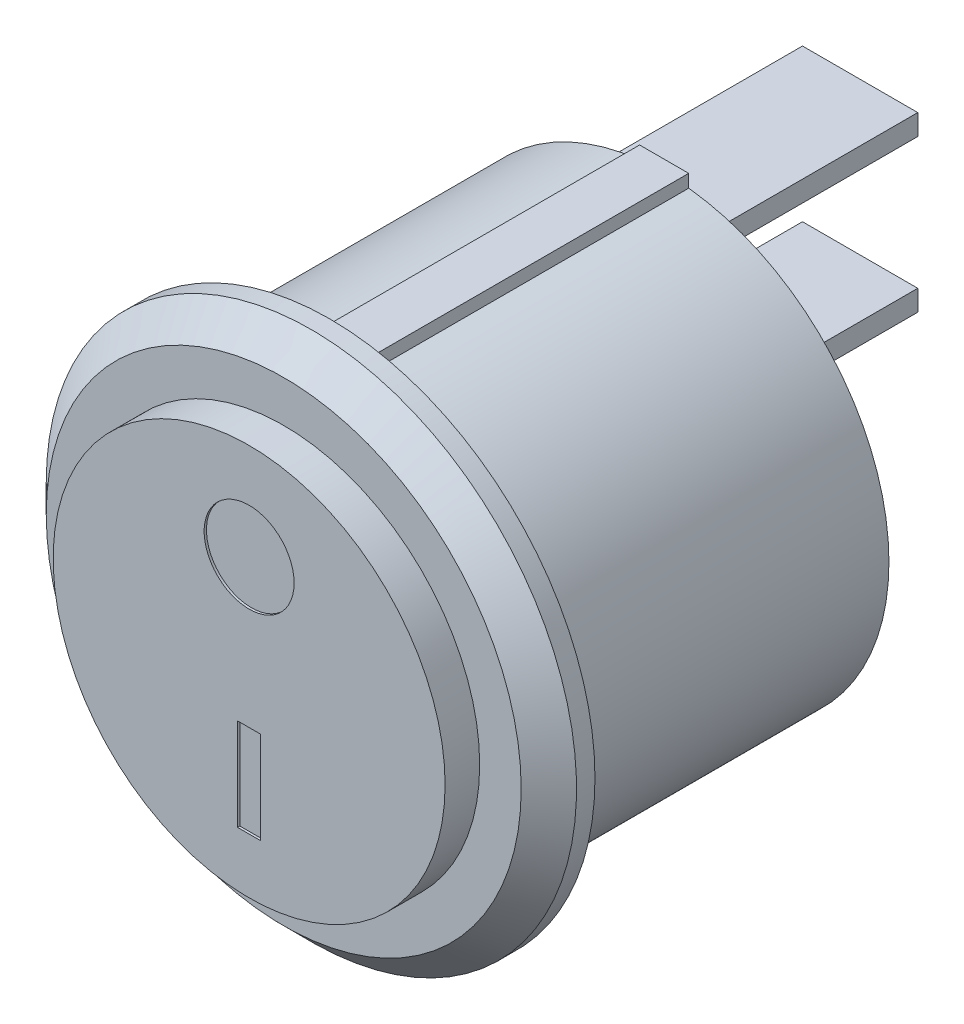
ISO-10303-21;
HEADER;
FILE_DESCRIPTION(('STEP AP214'),'2;1');
FILE_NAME('part.step','',(''),(''),'','','');
FILE_SCHEMA(('AUTOMOTIVE_DESIGN { 1 0 10303 214 1 1 1 1 }'));
ENDSEC;
DATA;
#1=APPLICATION_CONTEXT('core data for automotive mechanical design processes');
#2=APPLICATION_PROTOCOL_DEFINITION('international standard','automotive_design',2000,#1);
#3=PRODUCT_CONTEXT('',#1,'mechanical');
#4=PRODUCT('Part','Part','',(#3));
#5=PRODUCT_RELATED_PRODUCT_CATEGORY('part','',(#4));
#6=PRODUCT_DEFINITION_FORMATION('','',#4);
#7=PRODUCT_DEFINITION_CONTEXT('part definition',#1,'design');
#8=PRODUCT_DEFINITION('design','',#6,#7);
#9=PRODUCT_DEFINITION_SHAPE('','',#8);
#10=(LENGTH_UNIT() NAMED_UNIT(*) SI_UNIT(.MILLI.,.METRE.));
#11=(NAMED_UNIT(*) PLANE_ANGLE_UNIT() SI_UNIT($,.RADIAN.));
#12=(NAMED_UNIT(*) SI_UNIT($,.STERADIAN.) SOLID_ANGLE_UNIT());
#13=UNCERTAINTY_MEASURE_WITH_UNIT(LENGTH_MEASURE(1.E-05),#10,'distance_accuracy_value','');
#14=(GEOMETRIC_REPRESENTATION_CONTEXT(3) GLOBAL_UNCERTAINTY_ASSIGNED_CONTEXT((#13)) GLOBAL_UNIT_ASSIGNED_CONTEXT((#10,
#11,#12)) REPRESENTATION_CONTEXT('',''));
#15=CARTESIAN_POINT('',(0.,0.,0.));
#16=DIRECTION('',(0.,0.,1.));
#17=DIRECTION('',(1.,0.,0.));
#18=AXIS2_PLACEMENT_3D('',#15,#16,#17);
#19=CARTESIAN_POINT('',(0.,0.,14.5));
#20=DIRECTION('',(0.,0.,-1.));
#21=DIRECTION('',(-1.,0.,0.));
#22=AXIS2_PLACEMENT_3D('',#19,#20,#21);
#23=CYLINDRICAL_SURFACE('',#22,9.75);
#24=CARTESIAN_POINT('',(0.,0.,14.5));
#25=DIRECTION('',(0.,0.,1.));
#26=DIRECTION('',(1.,0.,0.));
#27=AXIS2_PLACEMENT_3D('',#24,#25,#26);
#28=CIRCLE('',#27,9.75);
#29=CARTESIAN_POINT('',(-1.06515554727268,9.6916429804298,14.5));
#30=VERTEX_POINT('',#29);
#31=CARTESIAN_POINT('',(-1.06515554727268,-9.6916429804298,14.5));
#32=VERTEX_POINT('',#31);
#33=EDGE_CURVE('E217',#30,#32,#28,.T.);
#34=ORIENTED_EDGE('',*,*,#33,.F.);
#35=DIRECTION('',(0.,0.,-1.));
#36=VECTOR('',#35,1.);
#37=CARTESIAN_POINT('',(-1.06515554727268,9.6916429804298,14.5));
#38=LINE('',#37,#36);
#39=CARTESIAN_POINT('',(-1.06515554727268,9.6916429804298,0.));
#40=VERTEX_POINT('',#39);
#41=EDGE_CURVE('E242',#30,#40,#38,.T.);
#42=ORIENTED_EDGE('',*,*,#41,.T.);
#43=CARTESIAN_POINT('',(0.,0.,0.));
#44=DIRECTION('',(0.,0.,1.));
#45=DIRECTION('',(1.,0.,0.));
#46=AXIS2_PLACEMENT_3D('',#43,#44,#45);
#47=CIRCLE('',#46,9.75);
#48=CARTESIAN_POINT('',(-1.06515554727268,-9.6916429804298,0.));
#49=VERTEX_POINT('',#48);
#50=EDGE_CURVE('E402',#40,#49,#47,.T.);
#51=ORIENTED_EDGE('',*,*,#50,.T.);
#52=DIRECTION('',(0.,0.,-1.));
#53=VECTOR('',#52,1.);
#54=CARTESIAN_POINT('',(-1.06515554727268,-9.6916429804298,14.5));
#55=LINE('',#54,#53);
#56=EDGE_CURVE('E239',#49,#32,#55,.F.);
#57=ORIENTED_EDGE('',*,*,#56,.T.);
#58=EDGE_LOOP('',(#34,#42,#51,#57));
#59=FACE_BOUND('',#58,.T.);
#60=ADVANCED_FACE('F51',(#59),#23,.T.);
#61=CARTESIAN_POINT('',(0.,0.,0.));
#62=DIRECTION('',(0.,0.,1.));
#63=DIRECTION('',(1.,0.,0.));
#64=AXIS2_PLACEMENT_3D('',#61,#62,#63);
#65=PLANE('',#64);
#66=DIRECTION('',(0.,-1.,0.));
#67=VECTOR('',#66,1.);
#68=CARTESIAN_POINT('',(2.5,9.,0.));
#69=LINE('',#68,#67);
#70=CARTESIAN_POINT('',(2.5,9.,0.));
#71=VERTEX_POINT('',#70);
#72=CARTESIAN_POINT('',(2.5,8.1,0.));
#73=VERTEX_POINT('',#72);
#74=EDGE_CURVE('E278',#71,#73,#69,.T.);
#75=ORIENTED_EDGE('',*,*,#74,.F.);
#76=DIRECTION('',(1.,0.,0.));
#77=VECTOR('',#76,1.);
#78=CARTESIAN_POINT('',(2.5,9.,0.));
#79=LINE('',#78,#77);
#80=CARTESIAN_POINT('',(-2.5,9.,0.));
#81=VERTEX_POINT('',#80);
#82=EDGE_CURVE('E295',#81,#71,#79,.T.);
#83=ORIENTED_EDGE('',*,*,#82,.F.);
#84=DIRECTION('',(0.,1.,0.));
#85=VECTOR('',#84,1.);
#86=CARTESIAN_POINT('',(-2.5,9.,0.));
#87=LINE('',#86,#85);
#88=CARTESIAN_POINT('',(-2.5,8.1,0.));
#89=VERTEX_POINT('',#88);
#90=EDGE_CURVE('E311',#89,#81,#87,.T.);
#91=ORIENTED_EDGE('',*,*,#90,.F.);
#92=DIRECTION('',(-1.,0.,0.));
#93=VECTOR('',#92,1.);
#94=CARTESIAN_POINT('',(2.5,8.1,0.));
#95=LINE('',#94,#93);
#96=EDGE_CURVE('E308',#73,#89,#95,.T.);
#97=ORIENTED_EDGE('',*,*,#96,.F.);
#98=EDGE_LOOP('',(#75,#83,#91,#97));
#99=FACE_BOUND('',#98,.T.);
#100=DIRECTION('',(0.,-1.,0.));
#101=VECTOR('',#100,1.);
#102=CARTESIAN_POINT('',(2.5,2.4,0.));
#103=LINE('',#102,#101);
#104=CARTESIAN_POINT('',(2.5,2.4,0.));
#105=VERTEX_POINT('',#104);
#106=CARTESIAN_POINT('',(2.5,1.5,0.));
#107=VERTEX_POINT('',#106);
#108=EDGE_CURVE('E274',#105,#107,#103,.T.);
#109=ORIENTED_EDGE('',*,*,#108,.F.);
#110=DIRECTION('',(1.,0.,0.));
#111=VECTOR('',#110,1.);
#112=CARTESIAN_POINT('',(2.5,2.4,0.));
#113=LINE('',#112,#111);
#114=CARTESIAN_POINT('',(-2.5,2.4,0.));
#115=VERTEX_POINT('',#114);
#116=EDGE_CURVE('E263',#115,#105,#113,.T.);
#117=ORIENTED_EDGE('',*,*,#116,.F.);
#118=DIRECTION('',(0.,1.,0.));
#119=VECTOR('',#118,1.);
#120=CARTESIAN_POINT('',(-2.5,2.4,0.));
#121=LINE('',#120,#119);
#122=CARTESIAN_POINT('',(-2.5,1.5,0.));
#123=VERTEX_POINT('',#122);
#124=EDGE_CURVE('E266',#123,#115,#121,.T.);
#125=ORIENTED_EDGE('',*,*,#124,.F.);
#126=DIRECTION('',(-1.,0.,0.));
#127=VECTOR('',#126,1.);
#128=CARTESIAN_POINT('',(2.5,1.5,0.));
#129=LINE('',#128,#127);
#130=EDGE_CURVE('E271',#107,#123,#129,.T.);
#131=ORIENTED_EDGE('',*,*,#130,.F.);
#132=EDGE_LOOP('',(#109,#117,#125,#131));
#133=FACE_BOUND('',#132,.T.);
#134=CARTESIAN_POINT('',(1.06515554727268,-9.6916429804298,0.));
#135=VERTEX_POINT('',#134);
#136=CARTESIAN_POINT('',(1.06515554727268,9.6916429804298,0.));
#137=VERTEX_POINT('',#136);
#138=EDGE_CURVE('E397',#135,#137,#47,.T.);
#139=ORIENTED_EDGE('',*,*,#138,.F.);
#140=DIRECTION('',(0.,-1.,0.));
#141=VECTOR('',#140,1.);
#142=CARTESIAN_POINT('',(1.06515554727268,10.25,0.));
#143=LINE('',#142,#141);
#144=CARTESIAN_POINT('',(1.06515554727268,-10.25,0.));
#145=VERTEX_POINT('',#144);
#146=EDGE_CURVE('E453',#135,#145,#143,.T.);
#147=ORIENTED_EDGE('',*,*,#146,.T.);
#148=DIRECTION('',(-1.,0.,0.));
#149=VECTOR('',#148,1.);
#150=CARTESIAN_POINT('',(1.06515554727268,-10.25,0.));
#151=LINE('',#150,#149);
#152=CARTESIAN_POINT('',(-1.06515554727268,-10.25,0.));
#153=VERTEX_POINT('',#152);
#154=EDGE_CURVE('E454',#145,#153,#151,.T.);
#155=ORIENTED_EDGE('',*,*,#154,.T.);
#156=DIRECTION('',(0.,1.,0.));
#157=VECTOR('',#156,1.);
#158=CARTESIAN_POINT('',(-1.06515554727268,10.25,0.));
#159=LINE('',#158,#157);
#160=EDGE_CURVE('E196',#153,#49,#159,.T.);
#161=ORIENTED_EDGE('',*,*,#160,.T.);
#162=ORIENTED_EDGE('',*,*,#50,.F.);
#163=CARTESIAN_POINT('',(-1.06515554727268,10.25,0.));
#164=VERTEX_POINT('',#163);
#165=EDGE_CURVE('E457',#40,#164,#159,.T.);
#166=ORIENTED_EDGE('',*,*,#165,.T.);
#167=DIRECTION('',(1.,0.,0.));
#168=VECTOR('',#167,1.);
#169=CARTESIAN_POINT('',(1.06515554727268,10.25,0.));
#170=LINE('',#169,#168);
#171=CARTESIAN_POINT('',(1.06515554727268,10.25,0.));
#172=VERTEX_POINT('',#171);
#173=EDGE_CURVE('E210',#164,#172,#170,.T.);
#174=ORIENTED_EDGE('',*,*,#173,.T.);
#175=EDGE_CURVE('E458',#172,#137,#143,.T.);
#176=ORIENTED_EDGE('',*,*,#175,.T.);
#177=EDGE_LOOP('',(#139,#147,#155,#161,#162,#166,#174,#176));
#178=FACE_BOUND('',#177,.T.);
#179=ADVANCED_FACE('F437',(#99,#133,#178),#65,.F.);
#180=CARTESIAN_POINT('',(1.06515554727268,-9.6916429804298,14.5));
#181=VERTEX_POINT('',#180);
#182=CARTESIAN_POINT('',(1.06515554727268,9.6916429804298,14.5));
#183=VERTEX_POINT('',#182);
#184=EDGE_CURVE('E398',#181,#183,#28,.T.);
#185=ORIENTED_EDGE('',*,*,#184,.F.);
#186=DIRECTION('',(0.,0.,-1.));
#187=VECTOR('',#186,1.);
#188=CARTESIAN_POINT('',(1.06515554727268,-9.6916429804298,14.5));
#189=LINE('',#188,#187);
#190=EDGE_CURVE('E76',#181,#135,#189,.T.);
#191=ORIENTED_EDGE('',*,*,#190,.T.);
#192=ORIENTED_EDGE('',*,*,#138,.T.);
#193=DIRECTION('',(0.,0.,-1.));
#194=VECTOR('',#193,1.);
#195=CARTESIAN_POINT('',(1.06515554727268,9.6916429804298,14.5));
#196=LINE('',#195,#194);
#197=EDGE_CURVE('E233',#137,#183,#196,.F.);
#198=ORIENTED_EDGE('',*,*,#197,.T.);
#199=EDGE_LOOP('',(#185,#191,#192,#198));
#200=FACE_BOUND('',#199,.T.);
#201=ADVANCED_FACE('F432',(#200),#23,.T.);
#202=CARTESIAN_POINT('',(0.,0.,16.5));
#203=DIRECTION('',(0.,0.,-1.));
#204=DIRECTION('',(-1.,0.,0.));
#205=AXIS2_PLACEMENT_3D('',#202,#203,#204);
#206=CYLINDRICAL_SURFACE('',#205,11.5);
#207=CARTESIAN_POINT('',(0.,0.,15.3));
#208=DIRECTION('',(0.,0.,1.));
#209=DIRECTION('',(1.,0.,0.));
#210=AXIS2_PLACEMENT_3D('',#207,#208,#209);
#211=CIRCLE('',#210,11.5);
#212=CARTESIAN_POINT('',(-11.5,0.,15.3));
#213=VERTEX_POINT('',#212);
#214=EDGE_CURVE('E393',#213,#213,#211,.F.);
#215=ORIENTED_EDGE('',*,*,#214,.T.);
#216=EDGE_LOOP('',(#215));
#217=FACE_BOUND('',#216,.T.);
#218=CARTESIAN_POINT('',(0.,0.,14.5));
#219=DIRECTION('',(0.,0.,1.));
#220=DIRECTION('',(1.,0.,0.));
#221=AXIS2_PLACEMENT_3D('',#218,#219,#220);
#222=CIRCLE('',#221,11.5);
#223=CARTESIAN_POINT('',(11.5,0.,14.5));
#224=VERTEX_POINT('',#223);
#225=EDGE_CURVE('E388',#224,#224,#222,.T.);
#226=ORIENTED_EDGE('',*,*,#225,.T.);
#227=EDGE_LOOP('',(#226));
#228=FACE_BOUND('',#227,.T.);
#229=ADVANCED_FACE('F414',(#217,#228),#206,.T.);
#230=CARTESIAN_POINT('',(0.,0.,16.5));
#231=DIRECTION('',(0.,0.,1.));
#232=DIRECTION('',(1.,0.,0.));
#233=AXIS2_PLACEMENT_3D('',#230,#231,#232);
#234=PLANE('',#233);
#235=CARTESIAN_POINT('',(0.,0.,16.5));
#236=DIRECTION('',(0.,0.,1.));
#237=DIRECTION('',(1.,0.,0.));
#238=AXIS2_PLACEMENT_3D('',#235,#236,#237);
#239=CIRCLE('',#238,8.5);
#240=CARTESIAN_POINT('',(8.5,0.,16.5));
#241=VERTEX_POINT('',#240);
#242=EDGE_CURVE('E389',#241,#241,#239,.T.);
#243=ORIENTED_EDGE('',*,*,#242,.F.);
#244=EDGE_LOOP('',(#243));
#245=FACE_BOUND('',#244,.T.);
#246=CARTESIAN_POINT('',(0.,0.,16.5));
#247=DIRECTION('',(0.,0.,1.));
#248=DIRECTION('',(1.,0.,0.));
#249=AXIS2_PLACEMENT_3D('',#246,#247,#248);
#250=CIRCLE('',#249,10.3);
#251=CARTESIAN_POINT('',(-10.3,0.,16.5));
#252=VERTEX_POINT('',#251);
#253=EDGE_CURVE('E406',#252,#252,#250,.T.);
#254=ORIENTED_EDGE('',*,*,#253,.T.);
#255=EDGE_LOOP('',(#254));
#256=FACE_BOUND('',#255,.T.);
#257=ADVANCED_FACE('F422',(#245,#256),#234,.T.);
#258=CARTESIAN_POINT('',(0.,0.,14.5));
#259=DIRECTION('',(0.,0.,1.));
#260=DIRECTION('',(1.,0.,0.));
#261=AXIS2_PLACEMENT_3D('',#258,#259,#260);
#262=PLANE('',#261);
#263=ORIENTED_EDGE('',*,*,#33,.T.);
#264=DIRECTION('',(0.,1.,0.));
#265=VECTOR('',#264,1.);
#266=CARTESIAN_POINT('',(-1.06515554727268,10.25,14.5));
#267=LINE('',#266,#265);
#268=CARTESIAN_POINT('',(-1.06515554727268,-10.25,14.5));
#269=VERTEX_POINT('',#268);
#270=EDGE_CURVE('E193',#269,#32,#267,.T.);
#271=ORIENTED_EDGE('',*,*,#270,.F.);
#272=DIRECTION('',(-1.,0.,0.));
#273=VECTOR('',#272,1.);
#274=CARTESIAN_POINT('',(1.06515554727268,-10.25,14.5));
#275=LINE('',#274,#273);
#276=CARTESIAN_POINT('',(1.06515554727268,-10.25,14.5));
#277=VERTEX_POINT('',#276);
#278=EDGE_CURVE('E201',#277,#269,#275,.T.);
#279=ORIENTED_EDGE('',*,*,#278,.F.);
#280=DIRECTION('',(0.,1.,0.));
#281=VECTOR('',#280,1.);
#282=CARTESIAN_POINT('',(1.06515554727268,0.,14.5));
#283=LINE('',#282,#281);
#284=EDGE_CURVE('E11',#277,#181,#283,.T.);
#285=ORIENTED_EDGE('',*,*,#284,.T.);
#286=ORIENTED_EDGE('',*,*,#184,.T.);
#287=DIRECTION('',(0.,-1.,0.));
#288=VECTOR('',#287,1.);
#289=CARTESIAN_POINT('',(1.06515554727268,10.25,14.5));
#290=LINE('',#289,#288);
#291=CARTESIAN_POINT('',(1.06515554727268,10.25,14.5));
#292=VERTEX_POINT('',#291);
#293=EDGE_CURVE('E229',#292,#183,#290,.T.);
#294=ORIENTED_EDGE('',*,*,#293,.F.);
#295=DIRECTION('',(1.,0.,0.));
#296=VECTOR('',#295,1.);
#297=CARTESIAN_POINT('',(1.06515554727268,10.25,14.5));
#298=LINE('',#297,#296);
#299=CARTESIAN_POINT('',(-1.06515554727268,10.25,14.5));
#300=VERTEX_POINT('',#299);
#301=EDGE_CURVE('E68',#300,#292,#298,.T.);
#302=ORIENTED_EDGE('',*,*,#301,.F.);
#303=DIRECTION('',(0.,-1.,0.));
#304=VECTOR('',#303,1.);
#305=CARTESIAN_POINT('',(-1.06515554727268,0.,14.5));
#306=LINE('',#305,#304);
#307=EDGE_CURVE('E56',#300,#30,#306,.T.);
#308=ORIENTED_EDGE('',*,*,#307,.T.);
#309=EDGE_LOOP('',(#263,#271,#279,#285,#286,#294,#302,#308));
#310=FACE_BOUND('',#309,.T.);
#311=ORIENTED_EDGE('',*,*,#225,.F.);
#312=EDGE_LOOP('',(#311));
#313=FACE_BOUND('',#312,.T.);
#314=ADVANCED_FACE('F213',(#310,#313),#262,.F.);
#315=CARTESIAN_POINT('',(0.,0.,16.5));
#316=DIRECTION('',(0.,0.,-1.));
#317=DIRECTION('',(-1.,0.,0.));
#318=AXIS2_PLACEMENT_3D('',#315,#316,#317);
#319=CONICAL_SURFACE('',#318,10.3,0.785398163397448);
#320=CARTESIAN_POINT('',(-11.5,0.,15.3));
#321=CARTESIAN_POINT('',(-11.4875,0.,15.3125));
#322=CARTESIAN_POINT('',(-11.475,0.,15.325));
#323=CARTESIAN_POINT('',(-11.45,0.,15.35));
#324=CARTESIAN_POINT('',(-11.4375,0.,15.3625));
#325=CARTESIAN_POINT('',(-11.4125,0.,15.3875));
#326=CARTESIAN_POINT('',(-11.4,0.,15.4));
#327=CARTESIAN_POINT('',(-11.375,0.,15.425));
#328=CARTESIAN_POINT('',(-11.3625,0.,15.4375));
#329=CARTESIAN_POINT('',(-11.3375,0.,15.4625));
#330=CARTESIAN_POINT('',(-11.325,0.,15.475));
#331=CARTESIAN_POINT('',(-11.3,0.,15.5));
#332=CARTESIAN_POINT('',(-11.2875,0.,15.5125));
#333=CARTESIAN_POINT('',(-11.2625,0.,15.5375));
#334=CARTESIAN_POINT('',(-11.25,0.,15.55));
#335=CARTESIAN_POINT('',(-11.225,0.,15.575));
#336=CARTESIAN_POINT('',(-11.2125,0.,15.5875));
#337=CARTESIAN_POINT('',(-11.1875,0.,15.6125));
#338=CARTESIAN_POINT('',(-11.175,0.,15.625));
#339=CARTESIAN_POINT('',(-11.15,0.,15.65));
#340=CARTESIAN_POINT('',(-11.1375,0.,15.6625));
#341=CARTESIAN_POINT('',(-11.1125,0.,15.6875));
#342=CARTESIAN_POINT('',(-11.1,0.,15.7));
#343=CARTESIAN_POINT('',(-11.075,0.,15.725));
#344=CARTESIAN_POINT('',(-11.0625,0.,15.7375));
#345=CARTESIAN_POINT('',(-11.0375,0.,15.7625));
#346=CARTESIAN_POINT('',(-11.025,0.,15.775));
#347=CARTESIAN_POINT('',(-11.,0.,15.8));
#348=CARTESIAN_POINT('',(-10.9875,0.,15.8125));
#349=CARTESIAN_POINT('',(-10.9625,0.,15.8375));
#350=CARTESIAN_POINT('',(-10.95,0.,15.85));
#351=CARTESIAN_POINT('',(-10.925,0.,15.875));
#352=CARTESIAN_POINT('',(-10.9125,0.,15.8875));
#353=CARTESIAN_POINT('',(-10.8875,0.,15.9125));
#354=CARTESIAN_POINT('',(-10.875,0.,15.925));
#355=CARTESIAN_POINT('',(-10.85,0.,15.95));
#356=CARTESIAN_POINT('',(-10.8375,0.,15.9625));
#357=CARTESIAN_POINT('',(-10.8125,0.,15.9875));
#358=CARTESIAN_POINT('',(-10.8,0.,16.));
#359=CARTESIAN_POINT('',(-10.775,0.,16.025));
#360=CARTESIAN_POINT('',(-10.7625,0.,16.0375));
#361=CARTESIAN_POINT('',(-10.7375,0.,16.0625));
#362=CARTESIAN_POINT('',(-10.725,0.,16.075));
#363=CARTESIAN_POINT('',(-10.7,0.,16.1));
#364=CARTESIAN_POINT('',(-10.6875,0.,16.1125));
#365=CARTESIAN_POINT('',(-10.6625,0.,16.1375));
#366=CARTESIAN_POINT('',(-10.65,0.,16.15));
#367=CARTESIAN_POINT('',(-10.625,0.,16.175));
#368=CARTESIAN_POINT('',(-10.6125,0.,16.1875));
#369=CARTESIAN_POINT('',(-10.5875,0.,16.2125));
#370=CARTESIAN_POINT('',(-10.575,0.,16.225));
#371=CARTESIAN_POINT('',(-10.55,0.,16.25));
#372=CARTESIAN_POINT('',(-10.5375,0.,16.2625));
#373=CARTESIAN_POINT('',(-10.5125,0.,16.2875));
#374=CARTESIAN_POINT('',(-10.5,0.,16.3));
#375=CARTESIAN_POINT('',(-10.475,0.,16.325));
#376=CARTESIAN_POINT('',(-10.4625,0.,16.3375));
#377=CARTESIAN_POINT('',(-10.4375,0.,16.3625));
#378=CARTESIAN_POINT('',(-10.425,0.,16.375));
#379=CARTESIAN_POINT('',(-10.4,0.,16.4));
#380=CARTESIAN_POINT('',(-10.3875,0.,16.4125));
#381=CARTESIAN_POINT('',(-10.3625,0.,16.4375));
#382=CARTESIAN_POINT('',(-10.35,0.,16.45));
#383=CARTESIAN_POINT('',(-10.325,0.,16.475));
#384=CARTESIAN_POINT('',(-10.3125,0.,16.4875));
#385=CARTESIAN_POINT('',(-10.3,0.,16.5));
#386=B_SPLINE_CURVE_WITH_KNOTS('',3,(#320,#321,#322,#323,#324,#325,#326,#327,#328,#329,#330,
#331,#332,#333,#334,#335,#336,#337,#338,#339,#340,#341,#342,#343,#344,#345,#346,#347,#348,#349,
#350,#351,#352,#353,#354,#355,#356,#357,#358,#359,#360,#361,#362,#363,#364,#365,#366,#367,#368,
#369,#370,#371,#372,#373,#374,#375,#376,#377,#378,#379,#380,#381,#382,#383,#384,#385),
.UNSPECIFIED.,.F.,.F.,(4,2,2,2,2,2,2,2,2,2,2,2,2,2,2,2,2,2,2,2,2,2,2,2,2,2,2,2,2,2,2,2,4),(0.,
0.0530330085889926,0.106066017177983,0.159099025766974,0.212132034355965,0.265165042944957,
0.318198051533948,0.371231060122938,0.42426406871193,0.477297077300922,0.530330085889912,
0.583363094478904,0.636396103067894,0.689429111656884,0.742462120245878,0.795495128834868,
0.848528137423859,0.90156114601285,0.954594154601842,1.00762716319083,1.06066017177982,
1.11369318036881,1.1667261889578,1.2197591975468,1.27279220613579,1.32582521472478,
1.37885822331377,1.43189123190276,1.48492424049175,1.53795724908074,1.59099025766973,
1.64402326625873,1.69705627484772),.UNSPECIFIED.);
#387=EDGE_CURVE('BSEAM54',#213,#252,#386,.T.);
#388=ORIENTED_EDGE('',*,*,#214,.F.);
#389=ORIENTED_EDGE('',*,*,#253,.F.);
#390=ORIENTED_EDGE('',*,*,#387,.T.);
#391=ORIENTED_EDGE('',*,*,#387,.F.);
#392=EDGE_LOOP('',(#388,#390,#389,#391));
#393=FACE_BOUND('',#392,.T.);
#394=ADVANCED_FACE('F54',(#393),#319,.T.);
#395=CARTESIAN_POINT('',(0.,0.,18.));
#396=DIRECTION('',(0.,0.,-1.));
#397=DIRECTION('',(-1.,0.,0.));
#398=AXIS2_PLACEMENT_3D('',#395,#396,#397);
#399=CYLINDRICAL_SURFACE('',#398,8.5);
#400=CARTESIAN_POINT('',(0.,0.,18.));
#401=DIRECTION('',(0.,0.,1.));
#402=DIRECTION('',(1.,0.,0.));
#403=AXIS2_PLACEMENT_3D('',#400,#401,#402);
#404=CIRCLE('',#403,8.5);
#405=CARTESIAN_POINT('',(8.5,0.,18.));
#406=VERTEX_POINT('',#405);
#407=EDGE_CURVE('E337',#406,#406,#404,.T.);
#408=ORIENTED_EDGE('',*,*,#407,.F.);
#409=EDGE_LOOP('',(#408));
#410=FACE_BOUND('',#409,.T.);
#411=ORIENTED_EDGE('',*,*,#242,.T.);
#412=EDGE_LOOP('',(#411));
#413=FACE_BOUND('',#412,.T.);
#414=ADVANCED_FACE('F419',(#410,#413),#399,.T.);
#415=CARTESIAN_POINT('',(0.,0.,18.));
#416=DIRECTION('',(0.,0.,1.));
#417=DIRECTION('',(1.,0.,0.));
#418=AXIS2_PLACEMENT_3D('',#415,#416,#417);
#419=PLANE('',#418);
#420=CARTESIAN_POINT('',(0.,4.3,18.));
#421=DIRECTION('',(0.,0.,1.));
#422=DIRECTION('',(1.,0.,0.));
#423=AXIS2_PLACEMENT_3D('',#420,#421,#422);
#424=CIRCLE('',#423,1.95047820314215);
#425=CARTESIAN_POINT('',(1.95047820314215,4.3,18.));
#426=VERTEX_POINT('',#425);
#427=EDGE_CURVE('E338',#426,#426,#424,.T.);
#428=ORIENTED_EDGE('',*,*,#427,.F.);
#429=EDGE_LOOP('',(#428));
#430=FACE_BOUND('',#429,.T.);
#431=DIRECTION('',(0.,-1.,0.));
#432=VECTOR('',#431,1.);
#433=CARTESIAN_POINT('',(-0.5,-2.1,18.));
#434=LINE('',#433,#432);
#435=CARTESIAN_POINT('',(-0.5,-2.1,18.));
#436=VERTEX_POINT('',#435);
#437=CARTESIAN_POINT('',(-0.500000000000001,-6.1,18.));
#438=VERTEX_POINT('',#437);
#439=EDGE_CURVE('E342',#436,#438,#434,.T.);
#440=ORIENTED_EDGE('',*,*,#439,.F.);
#441=DIRECTION('',(-1.,0.,0.));
#442=VECTOR('',#441,1.);
#443=CARTESIAN_POINT('',(-0.5,-2.1,18.));
#444=LINE('',#443,#442);
#445=CARTESIAN_POINT('',(0.5,-2.1,18.));
#446=VERTEX_POINT('',#445);
#447=EDGE_CURVE('E356',#446,#436,#444,.T.);
#448=ORIENTED_EDGE('',*,*,#447,.F.);
#449=DIRECTION('',(0.,1.,0.));
#450=VECTOR('',#449,1.);
#451=CARTESIAN_POINT('',(0.5,-2.1,18.));
#452=LINE('',#451,#450);
#453=CARTESIAN_POINT('',(0.500000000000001,-6.1,18.));
#454=VERTEX_POINT('',#453);
#455=EDGE_CURVE('E360',#454,#446,#452,.T.);
#456=ORIENTED_EDGE('',*,*,#455,.F.);
#457=DIRECTION('',(1.,0.,0.));
#458=VECTOR('',#457,1.);
#459=CARTESIAN_POINT('',(-0.500000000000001,-6.1,18.));
#460=LINE('',#459,#458);
#461=EDGE_CURVE('E365',#438,#454,#460,.T.);
#462=ORIENTED_EDGE('',*,*,#461,.F.);
#463=EDGE_LOOP('',(#440,#448,#456,#462));
#464=FACE_BOUND('',#463,.T.);
#465=ORIENTED_EDGE('',*,*,#407,.T.);
#466=EDGE_LOOP('',(#465));
#467=FACE_BOUND('',#466,.T.);
#468=ADVANCED_FACE('F547',(#430,#464,#467),#419,.T.);
#469=CARTESIAN_POINT('',(-0.5,-2.1,17.9));
#470=DIRECTION('',(-1.,0.,0.));
#471=DIRECTION('',(0.,-1.,0.));
#472=AXIS2_PLACEMENT_3D('',#469,#470,#471);
#473=PLANE('',#472);
#474=ORIENTED_EDGE('',*,*,#439,.T.);
#475=DIRECTION('',(0.,0.,1.));
#476=VECTOR('',#475,1.);
#477=CARTESIAN_POINT('',(-0.500000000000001,-6.1,17.9));
#478=LINE('',#477,#476);
#479=CARTESIAN_POINT('',(-0.500000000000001,-6.1,17.9));
#480=VERTEX_POINT('',#479);
#481=EDGE_CURVE('E343',#480,#438,#478,.T.);
#482=ORIENTED_EDGE('',*,*,#481,.F.);
#483=DIRECTION('',(0.,-1.,0.));
#484=VECTOR('',#483,1.);
#485=CARTESIAN_POINT('',(-0.5,-2.1,17.9));
#486=LINE('',#485,#484);
#487=CARTESIAN_POINT('',(-0.5,-2.1,17.9));
#488=VERTEX_POINT('',#487);
#489=EDGE_CURVE('E361',#488,#480,#486,.T.);
#490=ORIENTED_EDGE('',*,*,#489,.F.);
#491=DIRECTION('',(0.,0.,1.));
#492=VECTOR('',#491,1.);
#493=CARTESIAN_POINT('',(-0.5,-2.1,17.9));
#494=LINE('',#493,#492);
#495=EDGE_CURVE('E332',#488,#436,#494,.T.);
#496=ORIENTED_EDGE('',*,*,#495,.T.);
#497=EDGE_LOOP('',(#474,#482,#490,#496));
#498=FACE_BOUND('',#497,.T.);
#499=ADVANCED_FACE('F543',(#498),#473,.F.);
#500=CARTESIAN_POINT('',(-0.5,-2.1,17.9));
#501=DIRECTION('',(0.,1.,0.));
#502=DIRECTION('',(0.,0.,1.));
#503=AXIS2_PLACEMENT_3D('',#500,#501,#502);
#504=PLANE('',#503);
#505=ORIENTED_EDGE('',*,*,#447,.T.);
#506=ORIENTED_EDGE('',*,*,#495,.F.);
#507=DIRECTION('',(-1.,0.,0.));
#508=VECTOR('',#507,1.);
#509=CARTESIAN_POINT('',(-0.5,-2.1,17.9));
#510=LINE('',#509,#508);
#511=CARTESIAN_POINT('',(0.5,-2.1,17.9));
#512=VERTEX_POINT('',#511);
#513=EDGE_CURVE('E347',#512,#488,#510,.T.);
#514=ORIENTED_EDGE('',*,*,#513,.F.);
#515=DIRECTION('',(0.,0.,1.));
#516=VECTOR('',#515,1.);
#517=CARTESIAN_POINT('',(0.5,-2.1,17.9));
#518=LINE('',#517,#516);
#519=EDGE_CURVE('E351',#512,#446,#518,.T.);
#520=ORIENTED_EDGE('',*,*,#519,.T.);
#521=EDGE_LOOP('',(#505,#506,#514,#520));
#522=FACE_BOUND('',#521,.T.);
#523=ADVANCED_FACE('F546',(#522),#504,.F.);
#524=CARTESIAN_POINT('',(0.5,-2.1,17.9));
#525=DIRECTION('',(1.,0.,0.));
#526=DIRECTION('',(0.,1.,0.));
#527=AXIS2_PLACEMENT_3D('',#524,#525,#526);
#528=PLANE('',#527);
#529=ORIENTED_EDGE('',*,*,#455,.T.);
#530=ORIENTED_EDGE('',*,*,#519,.F.);
#531=DIRECTION('',(0.,1.,0.));
#532=VECTOR('',#531,1.);
#533=CARTESIAN_POINT('',(0.5,-2.1,17.9));
#534=LINE('',#533,#532);
#535=CARTESIAN_POINT('',(0.500000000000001,-6.1,17.9));
#536=VERTEX_POINT('',#535);
#537=EDGE_CURVE('E374',#536,#512,#534,.T.);
#538=ORIENTED_EDGE('',*,*,#537,.F.);
#539=DIRECTION('',(0.,0.,1.));
#540=VECTOR('',#539,1.);
#541=CARTESIAN_POINT('',(0.500000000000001,-6.1,17.9));
#542=LINE('',#541,#540);
#543=EDGE_CURVE('E348',#536,#454,#542,.T.);
#544=ORIENTED_EDGE('',*,*,#543,.T.);
#545=EDGE_LOOP('',(#529,#530,#538,#544));
#546=FACE_BOUND('',#545,.T.);
#547=ADVANCED_FACE('F552',(#546),#528,.F.);
#548=CARTESIAN_POINT('',(-0.500000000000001,-6.1,17.9));
#549=DIRECTION('',(0.,-1.,0.));
#550=DIRECTION('',(0.,0.,-1.));
#551=AXIS2_PLACEMENT_3D('',#548,#549,#550);
#552=PLANE('',#551);
#553=ORIENTED_EDGE('',*,*,#461,.T.);
#554=ORIENTED_EDGE('',*,*,#543,.F.);
#555=DIRECTION('',(1.,0.,0.));
#556=VECTOR('',#555,1.);
#557=CARTESIAN_POINT('',(-0.500000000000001,-6.1,17.9));
#558=LINE('',#557,#556);
#559=EDGE_CURVE('E378',#480,#536,#558,.T.);
#560=ORIENTED_EDGE('',*,*,#559,.F.);
#561=ORIENTED_EDGE('',*,*,#481,.T.);
#562=EDGE_LOOP('',(#553,#554,#560,#561));
#563=FACE_BOUND('',#562,.T.);
#564=ADVANCED_FACE('F549',(#563),#552,.F.);
#565=CARTESIAN_POINT('',(0.,0.,17.9));
#566=DIRECTION('',(0.,0.,1.));
#567=DIRECTION('',(1.,0.,0.));
#568=AXIS2_PLACEMENT_3D('',#565,#566,#567);
#569=PLANE('',#568);
#570=ORIENTED_EDGE('',*,*,#489,.T.);
#571=ORIENTED_EDGE('',*,*,#559,.T.);
#572=ORIENTED_EDGE('',*,*,#537,.T.);
#573=ORIENTED_EDGE('',*,*,#513,.T.);
#574=EDGE_LOOP('',(#570,#571,#572,#573));
#575=FACE_BOUND('',#574,.T.);
#576=ADVANCED_FACE('F541',(#575),#569,.T.);
#577=CARTESIAN_POINT('',(0.,4.3,17.9));
#578=DIRECTION('',(0.,0.,1.));
#579=DIRECTION('',(1.,0.,0.));
#580=AXIS2_PLACEMENT_3D('',#577,#578,#579);
#581=CYLINDRICAL_SURFACE('',#580,1.95047820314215);
#582=CARTESIAN_POINT('',(0.,4.3,17.9));
#583=DIRECTION('',(0.,0.,1.));
#584=DIRECTION('',(1.,0.,0.));
#585=AXIS2_PLACEMENT_3D('',#582,#583,#584);
#586=CIRCLE('',#585,1.95047820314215);
#587=CARTESIAN_POINT('',(1.95047820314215,4.3,17.9));
#588=VERTEX_POINT('',#587);
#589=EDGE_CURVE('E333',#588,#588,#586,.T.);
#590=ORIENTED_EDGE('',*,*,#589,.F.);
#591=EDGE_LOOP('',(#590));
#592=FACE_BOUND('',#591,.T.);
#593=ORIENTED_EDGE('',*,*,#427,.T.);
#594=EDGE_LOOP('',(#593));
#595=FACE_BOUND('',#594,.T.);
#596=ADVANCED_FACE('F537',(#592,#595),#581,.F.);
#597=CARTESIAN_POINT('',(0.,4.3,17.9));
#598=DIRECTION('',(0.,0.,1.));
#599=DIRECTION('',(1.,0.,0.));
#600=AXIS2_PLACEMENT_3D('',#597,#598,#599);
#601=PLANE('',#600);
#602=ORIENTED_EDGE('',*,*,#589,.T.);
#603=EDGE_LOOP('',(#602));
#604=FACE_BOUND('',#603,.T.);
#605=ADVANCED_FACE('F533',(#604),#601,.T.);
#606=CARTESIAN_POINT('',(2.5,9.,-8.5));
#607=DIRECTION('',(-1.,0.,0.));
#608=DIRECTION('',(0.,-1.,0.));
#609=AXIS2_PLACEMENT_3D('',#606,#607,#608);
#610=PLANE('',#609);
#611=ORIENTED_EDGE('',*,*,#74,.T.);
#612=DIRECTION('',(0.,0.,1.));
#613=VECTOR('',#612,1.);
#614=CARTESIAN_POINT('',(2.5,8.1,-8.5));
#615=LINE('',#614,#613);
#616=CARTESIAN_POINT('',(2.5,8.1,-8.5));
#617=VERTEX_POINT('',#616);
#618=EDGE_CURVE('E328',#617,#73,#615,.T.);
#619=ORIENTED_EDGE('',*,*,#618,.F.);
#620=DIRECTION('',(0.,-1.,0.));
#621=VECTOR('',#620,1.);
#622=CARTESIAN_POINT('',(2.5,9.,-8.5));
#623=LINE('',#622,#621);
#624=CARTESIAN_POINT('',(2.5,9.,-8.5));
#625=VERTEX_POINT('',#624);
#626=EDGE_CURVE('E290',#625,#617,#623,.T.);
#627=ORIENTED_EDGE('',*,*,#626,.F.);
#628=DIRECTION('',(0.,0.,1.));
#629=VECTOR('',#628,1.);
#630=CARTESIAN_POINT('',(2.5,9.,-8.5));
#631=LINE('',#630,#629);
#632=EDGE_CURVE('E304',#625,#71,#631,.T.);
#633=ORIENTED_EDGE('',*,*,#632,.T.);
#634=EDGE_LOOP('',(#611,#619,#627,#633));
#635=FACE_BOUND('',#634,.T.);
#636=ADVANCED_FACE('F529',(#635),#610,.F.);
#637=CARTESIAN_POINT('',(2.5,8.1,-8.5));
#638=DIRECTION('',(0.,1.,0.));
#639=DIRECTION('',(0.,0.,1.));
#640=AXIS2_PLACEMENT_3D('',#637,#638,#639);
#641=PLANE('',#640);
#642=ORIENTED_EDGE('',*,*,#96,.T.);
#643=DIRECTION('',(0.,0.,1.));
#644=VECTOR('',#643,1.);
#645=CARTESIAN_POINT('',(-2.5,8.1,-8.5));
#646=LINE('',#645,#644);
#647=CARTESIAN_POINT('',(-2.5,8.1,-8.5));
#648=VERTEX_POINT('',#647);
#649=EDGE_CURVE('E324',#648,#89,#646,.T.);
#650=ORIENTED_EDGE('',*,*,#649,.F.);
#651=DIRECTION('',(-1.,0.,0.));
#652=VECTOR('',#651,1.);
#653=CARTESIAN_POINT('',(2.5,8.1,-8.5));
#654=LINE('',#653,#652);
#655=EDGE_CURVE('E294',#617,#648,#654,.T.);
#656=ORIENTED_EDGE('',*,*,#655,.F.);
#657=ORIENTED_EDGE('',*,*,#618,.T.);
#658=EDGE_LOOP('',(#642,#650,#656,#657));
#659=FACE_BOUND('',#658,.T.);
#660=ADVANCED_FACE('F525',(#659),#641,.F.);
#661=CARTESIAN_POINT('',(-2.5,9.,-8.5));
#662=DIRECTION('',(1.,0.,0.));
#663=DIRECTION('',(0.,1.,0.));
#664=AXIS2_PLACEMENT_3D('',#661,#662,#663);
#665=PLANE('',#664);
#666=ORIENTED_EDGE('',*,*,#90,.T.);
#667=DIRECTION('',(0.,0.,1.));
#668=VECTOR('',#667,1.);
#669=CARTESIAN_POINT('',(-2.5,9.,-8.5));
#670=LINE('',#669,#668);
#671=CARTESIAN_POINT('',(-2.5,9.,-8.5));
#672=VERTEX_POINT('',#671);
#673=EDGE_CURVE('E320',#672,#81,#670,.T.);
#674=ORIENTED_EDGE('',*,*,#673,.F.);
#675=DIRECTION('',(0.,1.,0.));
#676=VECTOR('',#675,1.);
#677=CARTESIAN_POINT('',(-2.5,9.,-8.5));
#678=LINE('',#677,#676);
#679=EDGE_CURVE('E298',#648,#672,#678,.T.);
#680=ORIENTED_EDGE('',*,*,#679,.F.);
#681=ORIENTED_EDGE('',*,*,#649,.T.);
#682=EDGE_LOOP('',(#666,#674,#680,#681));
#683=FACE_BOUND('',#682,.T.);
#684=ADVANCED_FACE('F521',(#683),#665,.F.);
#685=CARTESIAN_POINT('',(2.5,9.,-8.5));
#686=DIRECTION('',(0.,-1.,0.));
#687=DIRECTION('',(0.,0.,-1.));
#688=AXIS2_PLACEMENT_3D('',#685,#686,#687);
#689=PLANE('',#688);
#690=ORIENTED_EDGE('',*,*,#82,.T.);
#691=ORIENTED_EDGE('',*,*,#632,.F.);
#692=DIRECTION('',(1.,0.,0.));
#693=VECTOR('',#692,1.);
#694=CARTESIAN_POINT('',(2.5,9.,-8.5));
#695=LINE('',#694,#693);
#696=EDGE_CURVE('E301',#672,#625,#695,.T.);
#697=ORIENTED_EDGE('',*,*,#696,.F.);
#698=ORIENTED_EDGE('',*,*,#673,.T.);
#699=EDGE_LOOP('',(#690,#691,#697,#698));
#700=FACE_BOUND('',#699,.T.);
#701=ADVANCED_FACE('F517',(#700),#689,.F.);
#702=CARTESIAN_POINT('',(0.,0.,-8.5));
#703=DIRECTION('',(0.,0.,-1.));
#704=DIRECTION('',(-1.,0.,0.));
#705=AXIS2_PLACEMENT_3D('',#702,#703,#704);
#706=PLANE('',#705);
#707=ORIENTED_EDGE('',*,*,#626,.T.);
#708=ORIENTED_EDGE('',*,*,#655,.T.);
#709=ORIENTED_EDGE('',*,*,#679,.T.);
#710=ORIENTED_EDGE('',*,*,#696,.T.);
#711=EDGE_LOOP('',(#707,#708,#709,#710));
#712=FACE_BOUND('',#711,.T.);
#713=ADVANCED_FACE('F498',(#712),#706,.T.);
#714=CARTESIAN_POINT('',(2.5,2.4,-8.5));
#715=DIRECTION('',(-1.,0.,0.));
#716=DIRECTION('',(0.,-1.,0.));
#717=AXIS2_PLACEMENT_3D('',#714,#715,#716);
#718=PLANE('',#717);
#719=ORIENTED_EDGE('',*,*,#108,.T.);
#720=DIRECTION('',(0.,0.,1.));
#721=VECTOR('',#720,1.);
#722=CARTESIAN_POINT('',(2.5,1.5,-8.5));
#723=LINE('',#722,#721);
#724=CARTESIAN_POINT('',(2.5,1.5,-8.5));
#725=VERTEX_POINT('',#724);
#726=EDGE_CURVE('E246',#725,#107,#723,.T.);
#727=ORIENTED_EDGE('',*,*,#726,.F.);
#728=DIRECTION('',(0.,-1.,0.));
#729=VECTOR('',#728,1.);
#730=CARTESIAN_POINT('',(2.5,2.4,-8.5));
#731=LINE('',#730,#729);
#732=CARTESIAN_POINT('',(2.5,2.4,-8.5));
#733=VERTEX_POINT('',#732);
#734=EDGE_CURVE('E267',#733,#725,#731,.T.);
#735=ORIENTED_EDGE('',*,*,#734,.F.);
#736=DIRECTION('',(0.,0.,1.));
#737=VECTOR('',#736,1.);
#738=CARTESIAN_POINT('',(2.5,2.4,-8.5));
#739=LINE('',#738,#737);
#740=EDGE_CURVE('E258',#733,#105,#739,.T.);
#741=ORIENTED_EDGE('',*,*,#740,.T.);
#742=EDGE_LOOP('',(#719,#727,#735,#741));
#743=FACE_BOUND('',#742,.T.);
#744=ADVANCED_FACE('F494',(#743),#718,.F.);
#745=CARTESIAN_POINT('',(2.5,1.5,-8.5));
#746=DIRECTION('',(0.,1.,0.));
#747=DIRECTION('',(-1.,0.,0.));
#748=AXIS2_PLACEMENT_3D('',#745,#746,#747);
#749=PLANE('',#748);
#750=ORIENTED_EDGE('',*,*,#130,.T.);
#751=DIRECTION('',(0.,0.,1.));
#752=VECTOR('',#751,1.);
#753=CARTESIAN_POINT('',(-2.5,1.5,-8.5));
#754=LINE('',#753,#752);
#755=CARTESIAN_POINT('',(-2.5,1.5,-8.5));
#756=VERTEX_POINT('',#755);
#757=EDGE_CURVE('E250',#756,#123,#754,.T.);
#758=ORIENTED_EDGE('',*,*,#757,.F.);
#759=DIRECTION('',(-1.,0.,0.));
#760=VECTOR('',#759,1.);
#761=CARTESIAN_POINT('',(2.5,1.5,-8.5));
#762=LINE('',#761,#760);
#763=EDGE_CURVE('E284',#725,#756,#762,.T.);
#764=ORIENTED_EDGE('',*,*,#763,.F.);
#765=ORIENTED_EDGE('',*,*,#726,.T.);
#766=EDGE_LOOP('',(#750,#758,#764,#765));
#767=FACE_BOUND('',#766,.T.);
#768=ADVANCED_FACE('F497',(#767),#749,.F.);
#769=CARTESIAN_POINT('',(-2.5,2.4,-8.5));
#770=DIRECTION('',(1.,0.,0.));
#771=DIRECTION('',(0.,1.,0.));
#772=AXIS2_PLACEMENT_3D('',#769,#770,#771);
#773=PLANE('',#772);
#774=ORIENTED_EDGE('',*,*,#124,.T.);
#775=DIRECTION('',(0.,0.,1.));
#776=VECTOR('',#775,1.);
#777=CARTESIAN_POINT('',(-2.5,2.4,-8.5));
#778=LINE('',#777,#776);
#779=CARTESIAN_POINT('',(-2.5,2.4,-8.5));
#780=VERTEX_POINT('',#779);
#781=EDGE_CURVE('E254',#780,#115,#778,.T.);
#782=ORIENTED_EDGE('',*,*,#781,.F.);
#783=DIRECTION('',(0.,1.,0.));
#784=VECTOR('',#783,1.);
#785=CARTESIAN_POINT('',(-2.5,2.4,-8.5));
#786=LINE('',#785,#784);
#787=EDGE_CURVE('E281',#756,#780,#786,.T.);
#788=ORIENTED_EDGE('',*,*,#787,.F.);
#789=ORIENTED_EDGE('',*,*,#757,.T.);
#790=EDGE_LOOP('',(#774,#782,#788,#789));
#791=FACE_BOUND('',#790,.T.);
#792=ADVANCED_FACE('F502',(#791),#773,.F.);
#793=CARTESIAN_POINT('',(2.5,2.4,-8.5));
#794=DIRECTION('',(0.,-1.,0.));
#795=DIRECTION('',(1.,0.,0.));
#796=AXIS2_PLACEMENT_3D('',#793,#794,#795);
#797=PLANE('',#796);
#798=ORIENTED_EDGE('',*,*,#116,.T.);
#799=ORIENTED_EDGE('',*,*,#740,.F.);
#800=DIRECTION('',(1.,0.,0.));
#801=VECTOR('',#800,1.);
#802=CARTESIAN_POINT('',(2.5,2.4,-8.5));
#803=LINE('',#802,#801);
#804=EDGE_CURVE('E262',#780,#733,#803,.T.);
#805=ORIENTED_EDGE('',*,*,#804,.F.);
#806=ORIENTED_EDGE('',*,*,#781,.T.);
#807=EDGE_LOOP('',(#798,#799,#805,#806));
#808=FACE_BOUND('',#807,.T.);
#809=ADVANCED_FACE('F506',(#808),#797,.F.);
#810=CARTESIAN_POINT('',(0.,0.,-8.5));
#811=DIRECTION('',(0.,0.,-1.));
#812=DIRECTION('',(-1.,0.,0.));
#813=AXIS2_PLACEMENT_3D('',#810,#811,#812);
#814=PLANE('',#813);
#815=ORIENTED_EDGE('',*,*,#734,.T.);
#816=ORIENTED_EDGE('',*,*,#763,.T.);
#817=ORIENTED_EDGE('',*,*,#787,.T.);
#818=ORIENTED_EDGE('',*,*,#804,.T.);
#819=EDGE_LOOP('',(#815,#816,#817,#818));
#820=FACE_BOUND('',#819,.T.);
#821=ADVANCED_FACE('F510',(#820),#814,.T.);
#822=CARTESIAN_POINT('',(1.06515554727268,10.25,35.1103911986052));
#823=DIRECTION('',(1.,0.,0.));
#824=DIRECTION('',(0.,0.,-1.));
#825=AXIS2_PLACEMENT_3D('',#822,#823,#824);
#826=PLANE('',#825);
#827=ORIENTED_EDGE('',*,*,#197,.F.);
#828=ORIENTED_EDGE('',*,*,#175,.F.);
#829=DIRECTION('',(0.,0.,-1.));
#830=VECTOR('',#829,1.);
#831=CARTESIAN_POINT('',(1.06515554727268,10.25,35.1103911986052));
#832=LINE('',#831,#830);
#833=EDGE_CURVE('E227',#292,#172,#832,.T.);
#834=ORIENTED_EDGE('',*,*,#833,.F.);
#835=ORIENTED_EDGE('',*,*,#293,.T.);
#836=EDGE_LOOP('',(#827,#828,#834,#835));
#837=FACE_BOUND('',#836,.T.);
#838=ADVANCED_FACE('F468',(#837),#826,.T.);
#839=CARTESIAN_POINT('',(1.06515554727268,10.25,35.1103911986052));
#840=DIRECTION('',(0.,1.,0.));
#841=DIRECTION('',(0.,0.,1.));
#842=AXIS2_PLACEMENT_3D('',#839,#840,#841);
#843=PLANE('',#842);
#844=DIRECTION('',(0.,0.,-1.));
#845=VECTOR('',#844,1.);
#846=CARTESIAN_POINT('',(-1.06515554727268,10.25,35.1103911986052));
#847=LINE('',#846,#845);
#848=EDGE_CURVE('E219',#300,#164,#847,.T.);
#849=ORIENTED_EDGE('',*,*,#848,.F.);
#850=ORIENTED_EDGE('',*,*,#301,.T.);
#851=ORIENTED_EDGE('',*,*,#833,.T.);
#852=ORIENTED_EDGE('',*,*,#173,.F.);
#853=EDGE_LOOP('',(#849,#850,#851,#852));
#854=FACE_BOUND('',#853,.T.);
#855=ADVANCED_FACE('F472',(#854),#843,.T.);
#856=CARTESIAN_POINT('',(-1.06515554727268,10.25,35.1103911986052));
#857=DIRECTION('',(-1.,0.,0.));
#858=DIRECTION('',(0.,0.,1.));
#859=AXIS2_PLACEMENT_3D('',#856,#857,#858);
#860=PLANE('',#859);
#861=ORIENTED_EDGE('',*,*,#41,.F.);
#862=ORIENTED_EDGE('',*,*,#307,.F.);
#863=ORIENTED_EDGE('',*,*,#848,.T.);
#864=ORIENTED_EDGE('',*,*,#165,.F.);
#865=EDGE_LOOP('',(#861,#862,#863,#864));
#866=FACE_BOUND('',#865,.T.);
#867=ADVANCED_FACE('F480',(#866),#860,.T.);
#868=ORIENTED_EDGE('',*,*,#56,.F.);
#869=ORIENTED_EDGE('',*,*,#160,.F.);
#870=DIRECTION('',(0.,0.,-1.));
#871=VECTOR('',#870,1.);
#872=CARTESIAN_POINT('',(-1.06515554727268,-10.25,35.1103911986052));
#873=LINE('',#872,#871);
#874=EDGE_CURVE('E189',#269,#153,#873,.T.);
#875=ORIENTED_EDGE('',*,*,#874,.F.);
#876=ORIENTED_EDGE('',*,*,#270,.T.);
#877=EDGE_LOOP('',(#868,#869,#875,#876));
#878=FACE_BOUND('',#877,.T.);
#879=ADVANCED_FACE('F191',(#878),#860,.T.);
#880=ORIENTED_EDGE('',*,*,#190,.F.);
#881=ORIENTED_EDGE('',*,*,#284,.F.);
#882=DIRECTION('',(0.,0.,-1.));
#883=VECTOR('',#882,1.);
#884=CARTESIAN_POINT('',(1.06515554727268,-10.25,35.1103911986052));
#885=LINE('',#884,#883);
#886=EDGE_CURVE('E207',#277,#145,#885,.T.);
#887=ORIENTED_EDGE('',*,*,#886,.T.);
#888=ORIENTED_EDGE('',*,*,#146,.F.);
#889=EDGE_LOOP('',(#880,#881,#887,#888));
#890=FACE_BOUND('',#889,.T.);
#891=ADVANCED_FACE('F452',(#890),#826,.T.);
#892=CARTESIAN_POINT('',(1.06515554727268,-10.25,35.1103911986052));
#893=DIRECTION('',(0.,-1.,0.));
#894=DIRECTION('',(0.,0.,-1.));
#895=AXIS2_PLACEMENT_3D('',#892,#893,#894);
#896=PLANE('',#895);
#897=ORIENTED_EDGE('',*,*,#886,.F.);
#898=ORIENTED_EDGE('',*,*,#278,.T.);
#899=ORIENTED_EDGE('',*,*,#874,.T.);
#900=ORIENTED_EDGE('',*,*,#154,.F.);
#901=EDGE_LOOP('',(#897,#898,#899,#900));
#902=FACE_BOUND('',#901,.T.);
#903=ADVANCED_FACE('F205',(#902),#896,.T.);
#904=CLOSED_SHELL('',(#60,#179,#201,#229,#257,#314,#394,#414,#468,#499,#523,#547,#564,#576,#596,
#605,#636,#660,#684,#701,#713,#744,#768,#792,#809,#821,#838,#855,#867,#879,#891,#903));
#905=MANIFOLD_SOLID_BREP('B2',#904);
#906=ADVANCED_BREP_SHAPE_REPRESENTATION('',(#18,#905),#14);
#907=SHAPE_DEFINITION_REPRESENTATION(#9,#906);
ENDSEC;
END-ISO-10303-21;
